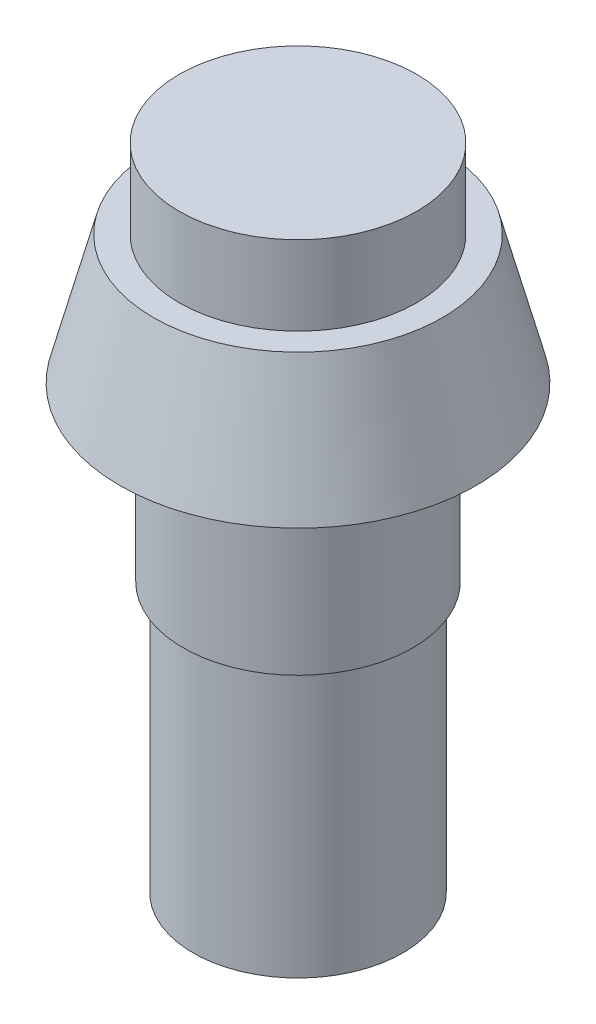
ISO-10303-21;
HEADER;
FILE_DESCRIPTION(('STEP AP214'),'2;1');
FILE_NAME('part.step','',(''),(''),'','','');
FILE_SCHEMA(('AUTOMOTIVE_DESIGN { 1 0 10303 214 1 1 1 1 }'));
ENDSEC;
DATA;
#1=APPLICATION_CONTEXT('core data for automotive mechanical design processes');
#2=APPLICATION_PROTOCOL_DEFINITION('international standard','automotive_design',2000,#1);
#3=PRODUCT_CONTEXT('',#1,'mechanical');
#4=PRODUCT('Part','Part','',(#3));
#5=PRODUCT_RELATED_PRODUCT_CATEGORY('part','',(#4));
#6=PRODUCT_DEFINITION_FORMATION('','',#4);
#7=PRODUCT_DEFINITION_CONTEXT('part definition',#1,'design');
#8=PRODUCT_DEFINITION('design','',#6,#7);
#9=PRODUCT_DEFINITION_SHAPE('','',#8);
#10=(LENGTH_UNIT() NAMED_UNIT(*) SI_UNIT(.MILLI.,.METRE.));
#11=(NAMED_UNIT(*) PLANE_ANGLE_UNIT() SI_UNIT($,.RADIAN.));
#12=(NAMED_UNIT(*) SI_UNIT($,.STERADIAN.) SOLID_ANGLE_UNIT());
#13=UNCERTAINTY_MEASURE_WITH_UNIT(LENGTH_MEASURE(1.E-05),#10,'distance_accuracy_value','');
#14=(GEOMETRIC_REPRESENTATION_CONTEXT(3) GLOBAL_UNCERTAINTY_ASSIGNED_CONTEXT((#13)) GLOBAL_UNIT_ASSIGNED_CONTEXT((#10,
#11,#12)) REPRESENTATION_CONTEXT('',''));
#15=CARTESIAN_POINT('',(0.,0.,0.));
#16=DIRECTION('',(0.,0.,1.));
#17=DIRECTION('',(1.,0.,0.));
#18=AXIS2_PLACEMENT_3D('',#15,#16,#17);
#19=CARTESIAN_POINT('',(0.,-8.7,0.));
#20=DIRECTION('',(0.,-1.,0.));
#21=DIRECTION('',(0.,0.,-1.));
#22=AXIS2_PLACEMENT_3D('',#19,#20,#21);
#23=PLANE('',#22);
#24=CARTESIAN_POINT('',(0.,-8.7,0.));
#25=DIRECTION('',(0.,-1.,0.));
#26=DIRECTION('',(0.,0.,-1.));
#27=AXIS2_PLACEMENT_3D('',#24,#25,#26);
#28=CIRCLE('',#27,5.8);
#29=CARTESIAN_POINT('',(0.,-8.7,-5.8));
#30=VERTEX_POINT('',#29);
#31=EDGE_CURVE('E10',#30,#30,#28,.T.);
#32=ORIENTED_EDGE('',*,*,#31,.T.);
#33=EDGE_LOOP('',(#32));
#34=FACE_BOUND('',#33,.T.);
#35=CARTESIAN_POINT('',(0.,-8.7,0.));
#36=DIRECTION('',(0.,-1.,0.));
#37=DIRECTION('',(0.,0.,-1.));
#38=AXIS2_PLACEMENT_3D('',#35,#36,#37);
#39=CIRCLE('',#38,5.30000000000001);
#40=CARTESIAN_POINT('',(0.,-8.7,-5.30000000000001));
#41=VERTEX_POINT('',#40);
#42=EDGE_CURVE('E64',#41,#41,#39,.T.);
#43=ORIENTED_EDGE('',*,*,#42,.F.);
#44=EDGE_LOOP('',(#43));
#45=FACE_BOUND('',#44,.T.);
#46=ADVANCED_FACE('F36',(#34,#45),#23,.T.);
#47=CARTESIAN_POINT('',(0.,0.,0.));
#48=DIRECTION('',(0.,-1.,0.));
#49=DIRECTION('',(0.,0.,-1.));
#50=AXIS2_PLACEMENT_3D('',#47,#48,#49);
#51=CYLINDRICAL_SURFACE('',#50,5.8);
#52=CARTESIAN_POINT('',(0.,0.,0.));
#53=DIRECTION('',(0.,-1.,0.));
#54=DIRECTION('',(0.,0.,-1.));
#55=AXIS2_PLACEMENT_3D('',#52,#53,#54);
#56=CIRCLE('',#55,5.8);
#57=CARTESIAN_POINT('',(0.,0.,-5.8));
#58=VERTEX_POINT('',#57);
#59=EDGE_CURVE('E42',#58,#58,#56,.T.);
#60=ORIENTED_EDGE('',*,*,#59,.T.);
#61=EDGE_LOOP('',(#60));
#62=FACE_BOUND('',#61,.T.);
#63=ORIENTED_EDGE('',*,*,#31,.F.);
#64=EDGE_LOOP('',(#63));
#65=FACE_BOUND('',#64,.T.);
#66=ADVANCED_FACE('F72',(#62,#65),#51,.T.);
#67=CARTESIAN_POINT('',(0.,0.,0.));
#68=DIRECTION('',(0.,1.,0.));
#69=DIRECTION('',(0.,0.,1.));
#70=AXIS2_PLACEMENT_3D('',#67,#68,#69);
#71=PLANE('',#70);
#72=ORIENTED_EDGE('',*,*,#59,.F.);
#73=EDGE_LOOP('',(#72));
#74=FACE_BOUND('',#73,.T.);
#75=CARTESIAN_POINT('',(0.,0.,0.));
#76=DIRECTION('',(0.,-1.,0.));
#77=DIRECTION('',(0.,0.,-1.));
#78=AXIS2_PLACEMENT_3D('',#75,#76,#77);
#79=CIRCLE('',#78,9.);
#80=CARTESIAN_POINT('',(0.,0.,-9.));
#81=VERTEX_POINT('',#80);
#82=EDGE_CURVE('E46',#81,#81,#79,.T.);
#83=ORIENTED_EDGE('',*,*,#82,.T.);
#84=EDGE_LOOP('',(#83));
#85=FACE_BOUND('',#84,.T.);
#86=ADVANCED_FACE('F76',(#74,#85),#71,.F.);
#87=CARTESIAN_POINT('',(0.,6.5,0.));
#88=DIRECTION('',(0.,-1.,0.));
#89=DIRECTION('',(0.,0.,-1.));
#90=AXIS2_PLACEMENT_3D('',#87,#88,#89);
#91=CONICAL_SURFACE('',#90,7.3,0.255808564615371);
#92=ORIENTED_EDGE('',*,*,#82,.F.);
#93=EDGE_LOOP('',(#92));
#94=FACE_BOUND('',#93,.T.);
#95=CARTESIAN_POINT('',(0.,6.5,0.));
#96=DIRECTION('',(0.,-1.,0.));
#97=DIRECTION('',(0.,0.,-1.));
#98=AXIS2_PLACEMENT_3D('',#95,#96,#97);
#99=CIRCLE('',#98,7.3);
#100=CARTESIAN_POINT('',(0.,6.5,-7.3));
#101=VERTEX_POINT('',#100);
#102=EDGE_CURVE('E50',#101,#101,#99,.T.);
#103=ORIENTED_EDGE('',*,*,#102,.T.);
#104=EDGE_LOOP('',(#103));
#105=FACE_BOUND('',#104,.T.);
#106=ADVANCED_FACE('F80',(#94,#105),#91,.T.);
#107=CARTESIAN_POINT('',(0.,6.5,0.));
#108=DIRECTION('',(0.,-1.,0.));
#109=DIRECTION('',(0.,0.,-1.));
#110=AXIS2_PLACEMENT_3D('',#107,#108,#109);
#111=PLANE('',#110);
#112=ORIENTED_EDGE('',*,*,#102,.F.);
#113=EDGE_LOOP('',(#112));
#114=FACE_BOUND('',#113,.T.);
#115=CARTESIAN_POINT('',(0.,6.5,0.));
#116=DIRECTION('',(0.,-1.,0.));
#117=DIRECTION('',(0.,0.,-1.));
#118=AXIS2_PLACEMENT_3D('',#115,#116,#117);
#119=CIRCLE('',#118,6.);
#120=CARTESIAN_POINT('',(0.,6.5,-6.));
#121=VERTEX_POINT('',#120);
#122=EDGE_CURVE('E55',#121,#121,#119,.T.);
#123=ORIENTED_EDGE('',*,*,#122,.T.);
#124=EDGE_LOOP('',(#123));
#125=FACE_BOUND('',#124,.T.);
#126=ADVANCED_FACE('F87',(#114,#125),#111,.F.);
#127=CARTESIAN_POINT('',(0.,0.,0.));
#128=DIRECTION('',(0.,-1.,0.));
#129=DIRECTION('',(0.,0.,-1.));
#130=AXIS2_PLACEMENT_3D('',#127,#128,#129);
#131=CYLINDRICAL_SURFACE('',#130,6.);
#132=ORIENTED_EDGE('',*,*,#122,.F.);
#133=EDGE_LOOP('',(#132));
#134=FACE_BOUND('',#133,.T.);
#135=CARTESIAN_POINT('',(0.,10.5,0.));
#136=DIRECTION('',(0.,-1.,0.));
#137=DIRECTION('',(0.,0.,-1.));
#138=AXIS2_PLACEMENT_3D('',#135,#136,#137);
#139=CIRCLE('',#138,6.);
#140=CARTESIAN_POINT('',(0.,10.5,-6.));
#141=VERTEX_POINT('',#140);
#142=EDGE_CURVE('E58',#141,#141,#139,.T.);
#143=ORIENTED_EDGE('',*,*,#142,.T.);
#144=EDGE_LOOP('',(#143));
#145=FACE_BOUND('',#144,.T.);
#146=ADVANCED_FACE('F91',(#134,#145),#131,.T.);
#147=CARTESIAN_POINT('',(0.,10.5,0.));
#148=DIRECTION('',(0.,-1.,0.));
#149=DIRECTION('',(0.,0.,-1.));
#150=AXIS2_PLACEMENT_3D('',#147,#148,#149);
#151=PLANE('',#150);
#152=ORIENTED_EDGE('',*,*,#142,.F.);
#153=EDGE_LOOP('',(#152));
#154=FACE_BOUND('',#153,.T.);
#155=ADVANCED_FACE('F95',(#154),#151,.F.);
#156=CARTESIAN_POINT('',(0.,-22.3,0.));
#157=DIRECTION('',(0.,-1.,0.));
#158=DIRECTION('',(0.,0.,-1.));
#159=AXIS2_PLACEMENT_3D('',#156,#157,#158);
#160=PLANE('',#159);
#161=CARTESIAN_POINT('',(0.,-22.3,0.));
#162=DIRECTION('',(0.,-1.,0.));
#163=DIRECTION('',(0.,0.,-1.));
#164=AXIS2_PLACEMENT_3D('',#161,#162,#163);
#165=CIRCLE('',#164,5.30000000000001);
#166=CARTESIAN_POINT('',(0.,-22.3,-5.30000000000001));
#167=VERTEX_POINT('',#166);
#168=EDGE_CURVE('E61',#167,#167,#165,.T.);
#169=ORIENTED_EDGE('',*,*,#168,.T.);
#170=EDGE_LOOP('',(#169));
#171=FACE_BOUND('',#170,.T.);
#172=ADVANCED_FACE('F99',(#171),#160,.T.);
#173=CARTESIAN_POINT('',(0.,0.,0.));
#174=DIRECTION('',(0.,-1.,0.));
#175=DIRECTION('',(0.,0.,-1.));
#176=AXIS2_PLACEMENT_3D('',#173,#174,#175);
#177=CYLINDRICAL_SURFACE('',#176,5.30000000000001);
#178=ORIENTED_EDGE('',*,*,#42,.T.);
#179=EDGE_LOOP('',(#178));
#180=FACE_BOUND('',#179,.T.);
#181=ORIENTED_EDGE('',*,*,#168,.F.);
#182=EDGE_LOOP('',(#181));
#183=FACE_BOUND('',#182,.T.);
#184=ADVANCED_FACE('F68',(#180,#183),#177,.T.);
#185=CLOSED_SHELL('',(#46,#66,#86,#106,#126,#146,#155,#172,#184));
#186=MANIFOLD_SOLID_BREP('B2',#185);
#187=ADVANCED_BREP_SHAPE_REPRESENTATION('',(#18,#186),#14);
#188=SHAPE_DEFINITION_REPRESENTATION(#9,#187);
ENDSEC;
END-ISO-10303-21;
